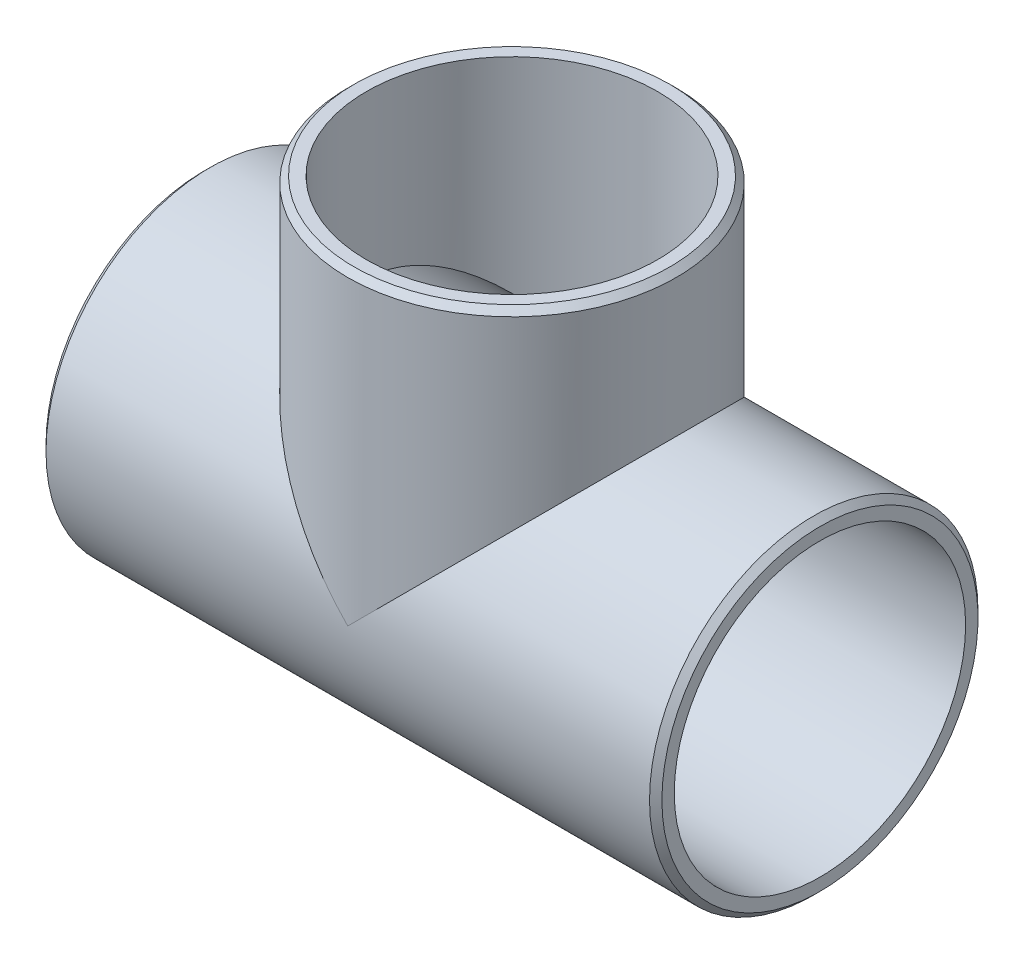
ISO-10303-21;
HEADER;
FILE_DESCRIPTION(('STEP AP214'),'2;1');
FILE_NAME('part.step','',(''),(''),'','','');
FILE_SCHEMA(('AUTOMOTIVE_DESIGN { 1 0 10303 214 1 1 1 1 }'));
ENDSEC;
DATA;
#1=APPLICATION_CONTEXT('core data for automotive mechanical design processes');
#2=APPLICATION_PROTOCOL_DEFINITION('international standard','automotive_design',2000,#1);
#3=PRODUCT_CONTEXT('',#1,'mechanical');
#4=PRODUCT('Part','Part','',(#3));
#5=PRODUCT_RELATED_PRODUCT_CATEGORY('part','',(#4));
#6=PRODUCT_DEFINITION_FORMATION('','',#4);
#7=PRODUCT_DEFINITION_CONTEXT('part definition',#1,'design');
#8=PRODUCT_DEFINITION('design','',#6,#7);
#9=PRODUCT_DEFINITION_SHAPE('','',#8);
#10=(LENGTH_UNIT() NAMED_UNIT(*) SI_UNIT(.MILLI.,.METRE.));
#11=(NAMED_UNIT(*) PLANE_ANGLE_UNIT() SI_UNIT($,.RADIAN.));
#12=(NAMED_UNIT(*) SI_UNIT($,.STERADIAN.) SOLID_ANGLE_UNIT());
#13=UNCERTAINTY_MEASURE_WITH_UNIT(LENGTH_MEASURE(1.E-05),#10,'distance_accuracy_value','');
#14=(GEOMETRIC_REPRESENTATION_CONTEXT(3) GLOBAL_UNCERTAINTY_ASSIGNED_CONTEXT((#13)) GLOBAL_UNIT_ASSIGNED_CONTEXT((#10,
#11,#12)) REPRESENTATION_CONTEXT('',''));
#15=CARTESIAN_POINT('',(0.,0.,0.));
#16=DIRECTION('',(0.,0.,1.));
#17=DIRECTION('',(1.,0.,0.));
#18=AXIS2_PLACEMENT_3D('',#15,#16,#17);
#19=CARTESIAN_POINT('',(-95.25,0.,0.));
#20=DIRECTION('',(-1.,0.,0.));
#21=DIRECTION('',(0.,0.,-1.));
#22=AXIS2_PLACEMENT_3D('',#19,#20,#21);
#23=PLANE('',#22);
#24=CARTESIAN_POINT('',(-95.25,0.,0.));
#25=DIRECTION('',(-1.,0.,0.));
#26=DIRECTION('',(0.,0.,1.));
#27=AXIS2_PLACEMENT_3D('',#24,#25,#26);
#28=CIRCLE('',#27,48.8865333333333);
#29=CARTESIAN_POINT('',(-95.25,0.,48.8865333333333));
#30=VERTEX_POINT('',#29);
#31=EDGE_CURVE('E40',#30,#30,#28,.T.);
#32=ORIENTED_EDGE('',*,*,#31,.T.);
#33=EDGE_LOOP('',(#32));
#34=FACE_BOUND('',#33,.T.);
#35=CARTESIAN_POINT('',(-95.25,0.,0.));
#36=DIRECTION('',(-1.,0.,0.));
#37=DIRECTION('',(0.,0.,1.));
#38=AXIS2_PLACEMENT_3D('',#35,#36,#37);
#39=CIRCLE('',#38,45.0596);
#40=CARTESIAN_POINT('',(-95.25,0.,45.0596));
#41=VERTEX_POINT('',#40);
#42=EDGE_CURVE('E67',#41,#41,#39,.F.);
#43=ORIENTED_EDGE('',*,*,#42,.T.);
#44=EDGE_LOOP('',(#43));
#45=FACE_BOUND('',#44,.T.);
#46=ADVANCED_FACE('F32',(#34,#45),#23,.T.);
#47=CARTESIAN_POINT('',(95.25,0.,0.));
#48=DIRECTION('',(-1.,0.,0.));
#49=DIRECTION('',(0.,0.,1.));
#50=AXIS2_PLACEMENT_3D('',#47,#48,#49);
#51=CYLINDRICAL_SURFACE('',#50,50.8);
#52=CARTESIAN_POINT('',(-93.3365333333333,0.,0.));
#53=DIRECTION('',(-1.,0.,0.));
#54=DIRECTION('',(0.,0.,1.));
#55=AXIS2_PLACEMENT_3D('',#52,#53,#54);
#56=CIRCLE('',#55,50.8);
#57=CARTESIAN_POINT('',(-93.3365333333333,0.,50.8));
#58=VERTEX_POINT('',#57);
#59=EDGE_CURVE('E86',#58,#58,#56,.F.);
#60=ORIENTED_EDGE('',*,*,#59,.T.);
#61=EDGE_LOOP('',(#60));
#62=FACE_BOUND('',#61,.T.);
#63=CARTESIAN_POINT('',(93.3365333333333,0.,0.));
#64=DIRECTION('',(1.,0.,0.));
#65=DIRECTION('',(0.,0.,-1.));
#66=AXIS2_PLACEMENT_3D('',#63,#64,#65);
#67=CIRCLE('',#66,50.8);
#68=CARTESIAN_POINT('',(93.3365333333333,0.,50.8));
#69=VERTEX_POINT('',#68);
#70=EDGE_CURVE('E83',#69,#69,#67,.F.);
#71=ORIENTED_EDGE('',*,*,#70,.T.);
#72=EDGE_LOOP('',(#71));
#73=FACE_BOUND('',#72,.T.);
#74=CARTESIAN_POINT('',(0.,0.,0.));
#75=DIRECTION('',(-0.707106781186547,-0.707106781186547,0.));
#76=DIRECTION('',(-0.707106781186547,0.707106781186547,0.));
#77=AXIS2_PLACEMENT_3D('',#74,#75,#76);
#78=ELLIPSE('',#77,71.8420489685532,50.8);
#79=CARTESIAN_POINT('',(0.,0.,-50.8));
#80=VERTEX_POINT('',#79);
#81=CARTESIAN_POINT('',(0.,0.,50.8));
#82=VERTEX_POINT('',#81);
#83=EDGE_CURVE('E49',#80,#82,#78,.F.);
#84=ORIENTED_EDGE('',*,*,#83,.F.);
#85=CARTESIAN_POINT('',(0.,0.,0.));
#86=DIRECTION('',(-0.707106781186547,0.707106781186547,0.));
#87=DIRECTION('',(-0.707106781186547,-0.707106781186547,0.));
#88=AXIS2_PLACEMENT_3D('',#85,#86,#87);
#89=ELLIPSE('',#88,71.8420489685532,50.8);
#90=EDGE_CURVE('E46',#82,#80,#89,.T.);
#91=ORIENTED_EDGE('',*,*,#90,.F.);
#92=EDGE_LOOP('',(#84,#91));
#93=FACE_BOUND('',#92,.T.);
#94=ADVANCED_FACE('F99',(#62,#73,#93),#51,.T.);
#95=CARTESIAN_POINT('',(95.25,0.,0.));
#96=DIRECTION('',(1.,0.,0.));
#97=DIRECTION('',(0.,0.,-1.));
#98=AXIS2_PLACEMENT_3D('',#95,#96,#97);
#99=PLANE('',#98);
#100=CARTESIAN_POINT('',(95.25,0.,0.));
#101=DIRECTION('',(1.,0.,0.));
#102=DIRECTION('',(0.,0.,-1.));
#103=AXIS2_PLACEMENT_3D('',#100,#101,#102);
#104=CIRCLE('',#103,48.8865333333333);
#105=CARTESIAN_POINT('',(95.25,0.,48.8865333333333));
#106=VERTEX_POINT('',#105);
#107=EDGE_CURVE('E11',#106,#106,#104,.T.);
#108=ORIENTED_EDGE('',*,*,#107,.T.);
#109=EDGE_LOOP('',(#108));
#110=FACE_BOUND('',#109,.T.);
#111=CARTESIAN_POINT('',(95.25,0.,0.));
#112=DIRECTION('',(1.,0.,0.));
#113=DIRECTION('',(0.,0.,-1.));
#114=AXIS2_PLACEMENT_3D('',#111,#112,#113);
#115=CIRCLE('',#114,45.0596);
#116=CARTESIAN_POINT('',(95.25,0.,-45.0596));
#117=VERTEX_POINT('',#116);
#118=EDGE_CURVE('E64',#117,#117,#115,.T.);
#119=ORIENTED_EDGE('',*,*,#118,.F.);
#120=EDGE_LOOP('',(#119));
#121=FACE_BOUND('',#120,.T.);
#122=ADVANCED_FACE('F102',(#110,#121),#99,.T.);
#123=CARTESIAN_POINT('',(0.,95.25,0.));
#124=DIRECTION('',(0.,-1.,0.));
#125=DIRECTION('',(0.,0.,-1.));
#126=AXIS2_PLACEMENT_3D('',#123,#124,#125);
#127=CYLINDRICAL_SURFACE('',#126,50.8);
#128=CARTESIAN_POINT('',(0.,93.3365333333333,0.));
#129=DIRECTION('',(0.,1.,0.));
#130=DIRECTION('',(0.,0.,1.));
#131=AXIS2_PLACEMENT_3D('',#128,#129,#130);
#132=CIRCLE('',#131,50.8);
#133=CARTESIAN_POINT('',(0.,93.3365333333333,-50.8));
#134=VERTEX_POINT('',#133);
#135=EDGE_CURVE('E80',#134,#134,#132,.F.);
#136=ORIENTED_EDGE('',*,*,#135,.T.);
#137=EDGE_LOOP('',(#136));
#138=FACE_BOUND('',#137,.T.);
#139=ORIENTED_EDGE('',*,*,#90,.T.);
#140=ORIENTED_EDGE('',*,*,#83,.T.);
#141=EDGE_LOOP('',(#139,#140));
#142=FACE_BOUND('',#141,.T.);
#143=ADVANCED_FACE('F112',(#138,#142),#127,.T.);
#144=CARTESIAN_POINT('',(0.,95.25,0.));
#145=DIRECTION('',(0.,1.,0.));
#146=DIRECTION('',(0.,0.,1.));
#147=AXIS2_PLACEMENT_3D('',#144,#145,#146);
#148=PLANE('',#147);
#149=CARTESIAN_POINT('',(0.,95.25,0.));
#150=DIRECTION('',(0.,1.,0.));
#151=DIRECTION('',(0.,0.,1.));
#152=AXIS2_PLACEMENT_3D('',#149,#150,#151);
#153=CIRCLE('',#152,48.8865333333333);
#154=CARTESIAN_POINT('',(0.,95.25,-48.8865333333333));
#155=VERTEX_POINT('',#154);
#156=EDGE_CURVE('E77',#155,#155,#153,.T.);
#157=ORIENTED_EDGE('',*,*,#156,.T.);
#158=EDGE_LOOP('',(#157));
#159=FACE_BOUND('',#158,.T.);
#160=CARTESIAN_POINT('',(0.,95.25,0.));
#161=DIRECTION('',(0.,1.,0.));
#162=DIRECTION('',(0.,0.,1.));
#163=AXIS2_PLACEMENT_3D('',#160,#161,#162);
#164=CIRCLE('',#163,45.0596);
#165=CARTESIAN_POINT('',(0.,95.25,45.0596));
#166=VERTEX_POINT('',#165);
#167=EDGE_CURVE('E71',#166,#166,#164,.T.);
#168=ORIENTED_EDGE('',*,*,#167,.F.);
#169=EDGE_LOOP('',(#168));
#170=FACE_BOUND('',#169,.T.);
#171=ADVANCED_FACE('F117',(#159,#170),#148,.T.);
#172=CARTESIAN_POINT('',(95.25,0.,0.));
#173=DIRECTION('',(-1.,0.,0.));
#174=DIRECTION('',(0.,0.,1.));
#175=AXIS2_PLACEMENT_3D('',#172,#173,#174);
#176=CYLINDRICAL_SURFACE('',#175,45.0596);
#177=ORIENTED_EDGE('',*,*,#42,.F.);
#178=EDGE_LOOP('',(#177));
#179=FACE_BOUND('',#178,.T.);
#180=ORIENTED_EDGE('',*,*,#118,.T.);
#181=EDGE_LOOP('',(#180));
#182=FACE_BOUND('',#181,.T.);
#183=CARTESIAN_POINT('',(0.,0.,0.));
#184=DIRECTION('',(-0.707106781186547,-0.707106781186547,0.));
#185=DIRECTION('',(-0.707106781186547,0.707106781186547,0.));
#186=AXIS2_PLACEMENT_3D('',#183,#184,#185);
#187=ELLIPSE('',#186,63.7238974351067,45.0596);
#188=CARTESIAN_POINT('',(0.,0.,-45.0596));
#189=VERTEX_POINT('',#188);
#190=CARTESIAN_POINT('',(0.,0.,45.0596));
#191=VERTEX_POINT('',#190);
#192=EDGE_CURVE('E57',#189,#191,#187,.F.);
#193=ORIENTED_EDGE('',*,*,#192,.T.);
#194=CARTESIAN_POINT('',(0.,0.,0.));
#195=DIRECTION('',(-0.707106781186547,0.707106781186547,0.));
#196=DIRECTION('',(-0.707106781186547,-0.707106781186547,0.));
#197=AXIS2_PLACEMENT_3D('',#194,#195,#196);
#198=ELLIPSE('',#197,63.7238974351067,45.0596);
#199=EDGE_CURVE('E60',#191,#189,#198,.T.);
#200=ORIENTED_EDGE('',*,*,#199,.T.);
#201=EDGE_LOOP('',(#193,#200));
#202=FACE_BOUND('',#201,.T.);
#203=ADVANCED_FACE('F63',(#179,#182,#202),#176,.F.);
#204=CARTESIAN_POINT('',(0.,95.25,0.));
#205=DIRECTION('',(0.,-1.,0.));
#206=DIRECTION('',(0.,0.,-1.));
#207=AXIS2_PLACEMENT_3D('',#204,#205,#206);
#208=CYLINDRICAL_SURFACE('',#207,45.0596);
#209=ORIENTED_EDGE('',*,*,#167,.T.);
#210=EDGE_LOOP('',(#209));
#211=FACE_BOUND('',#210,.T.);
#212=ORIENTED_EDGE('',*,*,#199,.F.);
#213=ORIENTED_EDGE('',*,*,#192,.F.);
#214=EDGE_LOOP('',(#212,#213));
#215=FACE_BOUND('',#214,.T.);
#216=ADVANCED_FACE('F59',(#211,#215),#208,.F.);
#217=CARTESIAN_POINT('',(0.,95.25,0.));
#218=DIRECTION('',(0.,-1.,0.));
#219=DIRECTION('',(0.,0.,-1.));
#220=AXIS2_PLACEMENT_3D('',#217,#218,#219);
#221=CONICAL_SURFACE('',#220,48.8865333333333,0.785398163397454);
#222=CARTESIAN_POINT('',(0.,93.3365333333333,-50.8));
#223=CARTESIAN_POINT('',(0.,93.3564652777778,-50.7800680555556));
#224=CARTESIAN_POINT('',(0.,93.3763972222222,-50.7601361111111));
#225=CARTESIAN_POINT('',(0.,93.4162611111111,-50.7202722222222));
#226=CARTESIAN_POINT('',(0.,93.4361930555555,-50.7003402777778));
#227=CARTESIAN_POINT('',(0.,93.4760569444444,-50.6604763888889));
#228=CARTESIAN_POINT('',(0.,93.4959888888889,-50.6405444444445));
#229=CARTESIAN_POINT('',(0.,93.5358527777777,-50.6006805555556));
#230=CARTESIAN_POINT('',(0.,93.5557847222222,-50.5807486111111));
#231=CARTESIAN_POINT('',(0.,93.5956486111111,-50.5408847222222));
#232=CARTESIAN_POINT('',(0.,93.6155805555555,-50.5209527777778));
#233=CARTESIAN_POINT('',(0.,93.6554444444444,-50.4810888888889));
#234=CARTESIAN_POINT('',(0.,93.6753763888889,-50.4611569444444));
#235=CARTESIAN_POINT('',(0.,93.7152402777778,-50.4212930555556));
#236=CARTESIAN_POINT('',(0.,93.7351722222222,-50.4013611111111));
#237=CARTESIAN_POINT('',(0.,93.7750361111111,-50.3614972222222));
#238=CARTESIAN_POINT('',(0.,93.7949680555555,-50.3415652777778));
#239=CARTESIAN_POINT('',(0.,93.8348319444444,-50.3017013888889));
#240=CARTESIAN_POINT('',(0.,93.8547638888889,-50.2817694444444));
#241=CARTESIAN_POINT('',(0.,93.8946277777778,-50.2419055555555));
#242=CARTESIAN_POINT('',(0.,93.9145597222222,-50.2219736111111));
#243=CARTESIAN_POINT('',(0.,93.9544236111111,-50.1821097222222));
#244=CARTESIAN_POINT('',(0.,93.9743555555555,-50.1621777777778));
#245=CARTESIAN_POINT('',(0.,94.0142194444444,-50.1223138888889));
#246=CARTESIAN_POINT('',(0.,94.0341513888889,-50.1023819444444));
#247=CARTESIAN_POINT('',(0.,94.0740152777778,-50.0625180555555));
#248=CARTESIAN_POINT('',(0.,94.0939472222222,-50.0425861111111));
#249=CARTESIAN_POINT('',(0.,94.1338111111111,-50.0027222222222));
#250=CARTESIAN_POINT('',(0.,94.1537430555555,-49.9827902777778));
#251=CARTESIAN_POINT('',(0.,94.1936069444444,-49.9429263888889));
#252=CARTESIAN_POINT('',(0.,94.2135388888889,-49.9229944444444));
#253=CARTESIAN_POINT('',(0.,94.2534027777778,-49.8831305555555));
#254=CARTESIAN_POINT('',(0.,94.2733347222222,-49.8631986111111));
#255=CARTESIAN_POINT('',(0.,94.3131986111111,-49.8233347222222));
#256=CARTESIAN_POINT('',(0.,94.3331305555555,-49.8034027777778));
#257=CARTESIAN_POINT('',(0.,94.3729944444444,-49.7635388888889));
#258=CARTESIAN_POINT('',(0.,94.3929263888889,-49.7436069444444));
#259=CARTESIAN_POINT('',(0.,94.4327902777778,-49.7037430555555));
#260=CARTESIAN_POINT('',(0.,94.4527222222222,-49.6838111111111));
#261=CARTESIAN_POINT('',(0.,94.4925861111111,-49.6439472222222));
#262=CARTESIAN_POINT('',(0.,94.5125180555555,-49.6240152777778));
#263=CARTESIAN_POINT('',(0.,94.5523819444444,-49.5841513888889));
#264=CARTESIAN_POINT('',(0.,94.5723138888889,-49.5642194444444));
#265=CARTESIAN_POINT('',(0.,94.6121777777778,-49.5243555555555));
#266=CARTESIAN_POINT('',(0.,94.6321097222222,-49.5044236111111));
#267=CARTESIAN_POINT('',(0.,94.6719736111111,-49.4645597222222));
#268=CARTESIAN_POINT('',(0.,94.6919055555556,-49.4446277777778));
#269=CARTESIAN_POINT('',(0.,94.7317694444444,-49.4047638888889));
#270=CARTESIAN_POINT('',(0.,94.7517013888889,-49.3848319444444));
#271=CARTESIAN_POINT('',(0.,94.7915652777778,-49.3449680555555));
#272=CARTESIAN_POINT('',(0.,94.8114972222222,-49.3250361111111));
#273=CARTESIAN_POINT('',(0.,94.8513611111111,-49.2851722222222));
#274=CARTESIAN_POINT('',(0.,94.8712930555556,-49.2652402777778));
#275=CARTESIAN_POINT('',(0.,94.9111569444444,-49.2253763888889));
#276=CARTESIAN_POINT('',(0.,94.9310888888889,-49.2054444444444));
#277=CARTESIAN_POINT('',(0.,94.9709527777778,-49.1655805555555));
#278=CARTESIAN_POINT('',(0.,94.9908847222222,-49.1456486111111));
#279=CARTESIAN_POINT('',(0.,95.0307486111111,-49.1057847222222));
#280=CARTESIAN_POINT('',(0.,95.0506805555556,-49.0858527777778));
#281=CARTESIAN_POINT('',(0.,95.0905444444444,-49.0459888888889));
#282=CARTESIAN_POINT('',(0.,95.1104763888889,-49.0260569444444));
#283=CARTESIAN_POINT('',(0.,95.1503402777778,-48.9861930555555));
#284=CARTESIAN_POINT('',(0.,95.1702722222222,-48.9662611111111));
#285=CARTESIAN_POINT('',(0.,95.2101361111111,-48.9263972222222));
#286=CARTESIAN_POINT('',(0.,95.2300680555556,-48.9064652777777));
#287=CARTESIAN_POINT('',(0.,95.25,-48.8865333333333));
#288=B_SPLINE_CURVE_WITH_KNOTS('',3,(#222,#223,#224,#225,#226,#227,#228,#229,#230,#231,#232,
#233,#234,#235,#236,#237,#238,#239,#240,#241,#242,#243,#244,#245,#246,#247,#248,#249,#250,#251,
#252,#253,#254,#255,#256,#257,#258,#259,#260,#261,#262,#263,#264,#265,#266,#267,#268,#269,#270,
#271,#272,#273,#274,#275,#276,#277,#278,#279,#280,#281,#282,#283,#284,#285,#286,#287),
.UNSPECIFIED.,.F.,.F.,(4,2,2,2,2,2,2,2,2,2,2,2,2,2,2,2,2,2,2,2,2,2,2,2,2,2,2,2,2,2,2,2,4),(0.,
0.0845640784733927,0.169128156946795,0.253692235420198,0.3382563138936,0.422820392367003,
0.507384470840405,0.591948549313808,0.676512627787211,0.761076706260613,0.845640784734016,
0.930204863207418,1.01476894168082,1.09933302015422,1.18389709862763,1.26846117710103,
1.35302525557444,1.43758933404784,1.52215341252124,1.60671749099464,1.69128156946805,
1.77584564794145,1.86040972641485,1.94497380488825,2.02953788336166,2.11410196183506,
2.19866604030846,2.28323011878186,2.36779419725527,2.45235827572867,2.53692235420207,
2.62148643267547,2.70605051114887),.UNSPECIFIED.);
#289=EDGE_CURVE('BSEAM96',#134,#155,#288,.T.);
#290=ORIENTED_EDGE('',*,*,#135,.F.);
#291=ORIENTED_EDGE('',*,*,#156,.F.);
#292=ORIENTED_EDGE('',*,*,#289,.T.);
#293=ORIENTED_EDGE('',*,*,#289,.F.);
#294=EDGE_LOOP('',(#290,#292,#291,#293));
#295=FACE_BOUND('',#294,.T.);
#296=ADVANCED_FACE('F96',(#295),#221,.T.);
#297=CARTESIAN_POINT('',(-93.3365333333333,0.,0.));
#298=DIRECTION('',(1.,0.,0.));
#299=DIRECTION('',(0.,0.,-1.));
#300=AXIS2_PLACEMENT_3D('',#297,#298,#299);
#301=CONICAL_SURFACE('',#300,50.8,0.78539816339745);
#302=ORIENTED_EDGE('',*,*,#31,.F.);
#303=EDGE_LOOP('',(#302));
#304=FACE_BOUND('',#303,.T.);
#305=ORIENTED_EDGE('',*,*,#59,.F.);
#306=EDGE_LOOP('',(#305));
#307=FACE_BOUND('',#306,.T.);
#308=ADVANCED_FACE('F93',(#304,#307),#301,.T.);
#309=CARTESIAN_POINT('',(95.25,0.,0.));
#310=DIRECTION('',(-1.,0.,0.));
#311=DIRECTION('',(0.,0.,1.));
#312=AXIS2_PLACEMENT_3D('',#309,#310,#311);
#313=CONICAL_SURFACE('',#312,48.8865333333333,0.785398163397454);
#314=CARTESIAN_POINT('',(93.3365333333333,0.,50.8));
#315=CARTESIAN_POINT('',(93.3564652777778,0.,50.7800680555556));
#316=CARTESIAN_POINT('',(93.3763972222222,0.,50.7601361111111));
#317=CARTESIAN_POINT('',(93.4162611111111,0.,50.7202722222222));
#318=CARTESIAN_POINT('',(93.4361930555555,0.,50.7003402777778));
#319=CARTESIAN_POINT('',(93.4760569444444,0.,50.6604763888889));
#320=CARTESIAN_POINT('',(93.4959888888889,0.,50.6405444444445));
#321=CARTESIAN_POINT('',(93.5358527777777,0.,50.6006805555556));
#322=CARTESIAN_POINT('',(93.5557847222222,0.,50.5807486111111));
#323=CARTESIAN_POINT('',(93.5956486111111,0.,50.5408847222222));
#324=CARTESIAN_POINT('',(93.6155805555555,0.,50.5209527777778));
#325=CARTESIAN_POINT('',(93.6554444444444,0.,50.4810888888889));
#326=CARTESIAN_POINT('',(93.6753763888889,0.,50.4611569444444));
#327=CARTESIAN_POINT('',(93.7152402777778,0.,50.4212930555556));
#328=CARTESIAN_POINT('',(93.7351722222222,0.,50.4013611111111));
#329=CARTESIAN_POINT('',(93.7750361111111,0.,50.3614972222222));
#330=CARTESIAN_POINT('',(93.7949680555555,0.,50.3415652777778));
#331=CARTESIAN_POINT('',(93.8348319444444,0.,50.3017013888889));
#332=CARTESIAN_POINT('',(93.8547638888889,0.,50.2817694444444));
#333=CARTESIAN_POINT('',(93.8946277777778,0.,50.2419055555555));
#334=CARTESIAN_POINT('',(93.9145597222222,0.,50.2219736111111));
#335=CARTESIAN_POINT('',(93.9544236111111,0.,50.1821097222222));
#336=CARTESIAN_POINT('',(93.9743555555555,0.,50.1621777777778));
#337=CARTESIAN_POINT('',(94.0142194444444,0.,50.1223138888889));
#338=CARTESIAN_POINT('',(94.0341513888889,0.,50.1023819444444));
#339=CARTESIAN_POINT('',(94.0740152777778,0.,50.0625180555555));
#340=CARTESIAN_POINT('',(94.0939472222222,0.,50.0425861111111));
#341=CARTESIAN_POINT('',(94.1338111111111,0.,50.0027222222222));
#342=CARTESIAN_POINT('',(94.1537430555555,0.,49.9827902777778));
#343=CARTESIAN_POINT('',(94.1936069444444,0.,49.9429263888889));
#344=CARTESIAN_POINT('',(94.2135388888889,0.,49.9229944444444));
#345=CARTESIAN_POINT('',(94.2534027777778,0.,49.8831305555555));
#346=CARTESIAN_POINT('',(94.2733347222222,0.,49.8631986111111));
#347=CARTESIAN_POINT('',(94.3131986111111,0.,49.8233347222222));
#348=CARTESIAN_POINT('',(94.3331305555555,0.,49.8034027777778));
#349=CARTESIAN_POINT('',(94.3729944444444,0.,49.7635388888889));
#350=CARTESIAN_POINT('',(94.3929263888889,0.,49.7436069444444));
#351=CARTESIAN_POINT('',(94.4327902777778,0.,49.7037430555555));
#352=CARTESIAN_POINT('',(94.4527222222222,0.,49.6838111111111));
#353=CARTESIAN_POINT('',(94.4925861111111,0.,49.6439472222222));
#354=CARTESIAN_POINT('',(94.5125180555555,0.,49.6240152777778));
#355=CARTESIAN_POINT('',(94.5523819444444,0.,49.5841513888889));
#356=CARTESIAN_POINT('',(94.5723138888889,0.,49.5642194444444));
#357=CARTESIAN_POINT('',(94.6121777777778,0.,49.5243555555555));
#358=CARTESIAN_POINT('',(94.6321097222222,0.,49.5044236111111));
#359=CARTESIAN_POINT('',(94.6719736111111,0.,49.4645597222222));
#360=CARTESIAN_POINT('',(94.6919055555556,0.,49.4446277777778));
#361=CARTESIAN_POINT('',(94.7317694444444,0.,49.4047638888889));
#362=CARTESIAN_POINT('',(94.7517013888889,0.,49.3848319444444));
#363=CARTESIAN_POINT('',(94.7915652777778,0.,49.3449680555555));
#364=CARTESIAN_POINT('',(94.8114972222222,0.,49.3250361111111));
#365=CARTESIAN_POINT('',(94.8513611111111,0.,49.2851722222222));
#366=CARTESIAN_POINT('',(94.8712930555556,0.,49.2652402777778));
#367=CARTESIAN_POINT('',(94.9111569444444,0.,49.2253763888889));
#368=CARTESIAN_POINT('',(94.9310888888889,0.,49.2054444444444));
#369=CARTESIAN_POINT('',(94.9709527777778,0.,49.1655805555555));
#370=CARTESIAN_POINT('',(94.9908847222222,0.,49.1456486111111));
#371=CARTESIAN_POINT('',(95.0307486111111,0.,49.1057847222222));
#372=CARTESIAN_POINT('',(95.0506805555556,0.,49.0858527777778));
#373=CARTESIAN_POINT('',(95.0905444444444,0.,49.0459888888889));
#374=CARTESIAN_POINT('',(95.1104763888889,0.,49.0260569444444));
#375=CARTESIAN_POINT('',(95.1503402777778,0.,48.9861930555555));
#376=CARTESIAN_POINT('',(95.1702722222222,0.,48.9662611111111));
#377=CARTESIAN_POINT('',(95.2101361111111,0.,48.9263972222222));
#378=CARTESIAN_POINT('',(95.2300680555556,0.,48.9064652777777));
#379=CARTESIAN_POINT('',(95.25,0.,48.8865333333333));
#380=B_SPLINE_CURVE_WITH_KNOTS('',3,(#314,#315,#316,#317,#318,#319,#320,#321,#322,#323,#324,
#325,#326,#327,#328,#329,#330,#331,#332,#333,#334,#335,#336,#337,#338,#339,#340,#341,#342,#343,
#344,#345,#346,#347,#348,#349,#350,#351,#352,#353,#354,#355,#356,#357,#358,#359,#360,#361,#362,
#363,#364,#365,#366,#367,#368,#369,#370,#371,#372,#373,#374,#375,#376,#377,#378,#379),
.UNSPECIFIED.,.F.,.F.,(4,2,2,2,2,2,2,2,2,2,2,2,2,2,2,2,2,2,2,2,2,2,2,2,2,2,2,2,2,2,2,2,4),(0.,
0.0845640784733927,0.169128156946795,0.253692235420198,0.3382563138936,0.422820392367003,
0.507384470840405,0.591948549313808,0.676512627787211,0.761076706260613,0.845640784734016,
0.930204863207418,1.01476894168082,1.09933302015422,1.18389709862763,1.26846117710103,
1.35302525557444,1.43758933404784,1.52215341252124,1.60671749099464,1.69128156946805,
1.77584564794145,1.86040972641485,1.94497380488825,2.02953788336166,2.11410196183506,
2.19866604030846,2.28323011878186,2.36779419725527,2.45235827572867,2.53692235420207,
2.62148643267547,2.70605051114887),.UNSPECIFIED.);
#381=EDGE_CURVE('BSEAM34',#69,#106,#380,.T.);
#382=ORIENTED_EDGE('',*,*,#70,.F.);
#383=ORIENTED_EDGE('',*,*,#107,.F.);
#384=ORIENTED_EDGE('',*,*,#381,.T.);
#385=ORIENTED_EDGE('',*,*,#381,.F.);
#386=EDGE_LOOP('',(#382,#384,#383,#385));
#387=FACE_BOUND('',#386,.T.);
#388=ADVANCED_FACE('F34',(#387),#313,.T.);
#389=CLOSED_SHELL('',(#46,#94,#122,#143,#171,#203,#216,#296,#308,#388));
#390=MANIFOLD_SOLID_BREP('B2',#389);
#391=ADVANCED_BREP_SHAPE_REPRESENTATION('',(#18,#390),#14);
#392=SHAPE_DEFINITION_REPRESENTATION(#9,#391);
ENDSEC;
END-ISO-10303-21;
